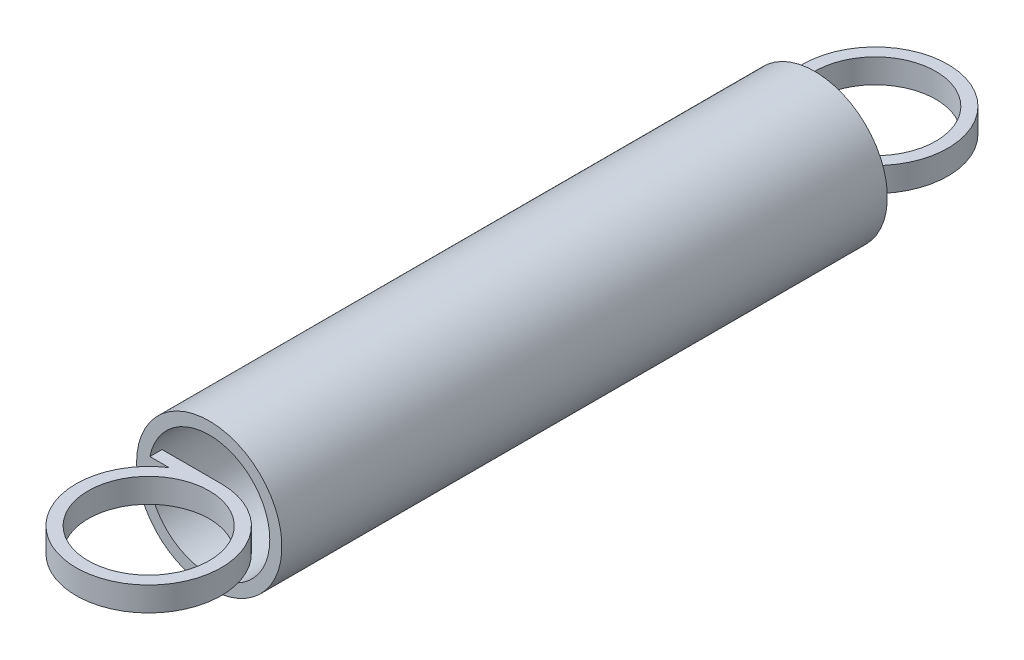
from build123d import *

# Parameters (mm, degrees)
ESQUISSE1_R            = 3
ESQUISSE1_R_2          = 2.5
BASE_EXTRU_MINCE_DEPTH = 12.5
ESQUISSE2_R            = 2.5
BOSS_EXTRU_1_DEPTH     = 0.5


with BuildPart() as part:
    # Esquisse1 → Base-Extru.-Mince (new, symmetric)
    with BuildSketch(Plane.XY):
        Circle(ESQUISSE1_R)
        Circle(ESQUISSE1_R_2, mode=Mode.SUBTRACT)
    extrude(amount=BASE_EXTRU_MINCE_DEPTH, both=True)

    # Esquisse2 → Boss.-Extru.1 (add, symmetric)
    with BuildSketch(Plane(origin=(0, 0, 0), x_dir=(1, 0, 0), z_dir=(0, 1, 0))):
        with BuildLine():
            Line((0, 12), (-2.7, 12))
            Line((-2.7, 12), (-2.7, 12.5))
            Line((-2.7, 12.5), (-1.658312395, 12.5))
            ThreePointArc((-1.658312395, 12.5), (0.866025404, 17.872281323), (0, 12))
        make_face()
        with Locations(Location((0, 15, 0), (0, 0, 270))):
            Circle(ESQUISSE2_R, mode=Mode.SUBTRACT)
    boss_extru_1 = extrude(amount=BOSS_EXTRU_1_DEPTH, both=True)

    # Sym_trie1: Boss.-Extru.1 across plane
    add(boss_extru_1.mirror(Plane.XY))


solid = part.part
